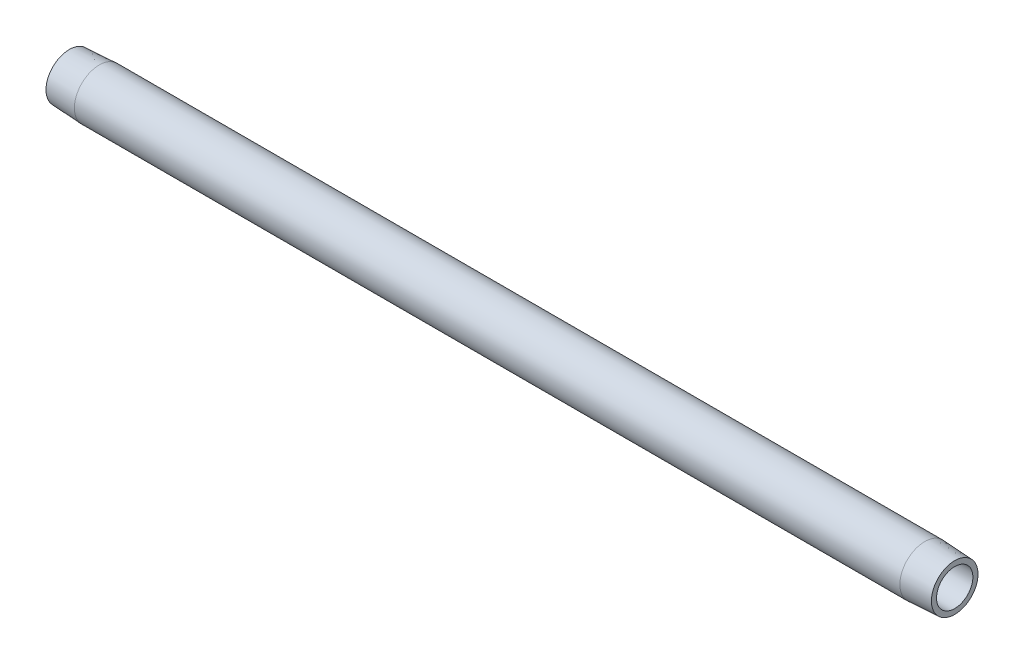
ISO-10303-21;
HEADER;
FILE_DESCRIPTION(('STEP AP214'),'2;1');
FILE_NAME('part.step','',(''),(''),'','','');
FILE_SCHEMA(('AUTOMOTIVE_DESIGN { 1 0 10303 214 1 1 1 1 }'));
ENDSEC;
DATA;
#1=APPLICATION_CONTEXT('core data for automotive mechanical design processes');
#2=APPLICATION_PROTOCOL_DEFINITION('international standard','automotive_design',2000,#1);
#3=PRODUCT_CONTEXT('',#1,'mechanical');
#4=PRODUCT('Part','Part','',(#3));
#5=PRODUCT_RELATED_PRODUCT_CATEGORY('part','',(#4));
#6=PRODUCT_DEFINITION_FORMATION('','',#4);
#7=PRODUCT_DEFINITION_CONTEXT('part definition',#1,'design');
#8=PRODUCT_DEFINITION('design','',#6,#7);
#9=PRODUCT_DEFINITION_SHAPE('','',#8);
#10=(LENGTH_UNIT() NAMED_UNIT(*) SI_UNIT(.MILLI.,.METRE.));
#11=(NAMED_UNIT(*) PLANE_ANGLE_UNIT() SI_UNIT($,.RADIAN.));
#12=(NAMED_UNIT(*) SI_UNIT($,.STERADIAN.) SOLID_ANGLE_UNIT());
#13=UNCERTAINTY_MEASURE_WITH_UNIT(LENGTH_MEASURE(1.E-05),#10,'distance_accuracy_value','');
#14=(GEOMETRIC_REPRESENTATION_CONTEXT(3) GLOBAL_UNCERTAINTY_ASSIGNED_CONTEXT((#13)) GLOBAL_UNIT_ASSIGNED_CONTEXT((#10,
#11,#12)) REPRESENTATION_CONTEXT('',''));
#15=CARTESIAN_POINT('',(0.,0.,0.));
#16=DIRECTION('',(0.,0.,1.));
#17=DIRECTION('',(1.,0.,0.));
#18=AXIS2_PLACEMENT_3D('',#15,#16,#17);
#19=CARTESIAN_POINT('',(304.8,6.26110000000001,0.));
#20=DIRECTION('',(-1.,0.,0.));
#21=DIRECTION('',(0.,0.,1.));
#22=AXIS2_PLACEMENT_3D('',#19,#20,#21);
#23=PLANE('',#22);
#24=CARTESIAN_POINT('',(304.8,0.,0.));
#25=DIRECTION('',(-1.,0.,0.));
#26=DIRECTION('',(0.,0.,1.));
#27=AXIS2_PLACEMENT_3D('',#24,#25,#26);
#28=CIRCLE('',#27,8.03205001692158);
#29=CARTESIAN_POINT('',(304.8,0.,8.03205001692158));
#30=VERTEX_POINT('',#29);
#31=EDGE_CURVE('E10',#30,#30,#28,.T.);
#32=ORIENTED_EDGE('',*,*,#31,.F.);
#33=EDGE_LOOP('',(#32));
#34=FACE_BOUND('',#33,.T.);
#35=CARTESIAN_POINT('',(304.8,0.,0.));
#36=DIRECTION('',(-1.,0.,0.));
#37=DIRECTION('',(0.,0.,1.));
#38=AXIS2_PLACEMENT_3D('',#35,#36,#37);
#39=CIRCLE('',#38,6.26110000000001);
#40=CARTESIAN_POINT('',(304.8,0.,6.26110000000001));
#41=VERTEX_POINT('',#40);
#42=EDGE_CURVE('E52',#41,#41,#39,.T.);
#43=ORIENTED_EDGE('',*,*,#42,.T.);
#44=EDGE_LOOP('',(#43));
#45=FACE_BOUND('',#44,.T.);
#46=ADVANCED_FACE('F30',(#34,#45),#23,.F.);
#47=CARTESIAN_POINT('',(304.8,0.,0.));
#48=DIRECTION('',(-1.,0.,0.));
#49=DIRECTION('',(0.,0.,1.));
#50=AXIS2_PLACEMENT_3D('',#47,#48,#49);
#51=CONICAL_SURFACE('',#50,8.03205001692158,0.0523598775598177);
#52=CARTESIAN_POINT('',(294.4876,0.,0.));
#53=DIRECTION('',(-1.,0.,0.));
#54=DIRECTION('',(0.,0.,1.));
#55=AXIS2_PLACEMENT_3D('',#52,#53,#54);
#56=CIRCLE('',#55,8.57249999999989);
#57=CARTESIAN_POINT('',(294.4876,0.,8.57249999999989));
#58=VERTEX_POINT('',#57);
#59=EDGE_CURVE('E36',#58,#58,#56,.T.);
#60=ORIENTED_EDGE('',*,*,#59,.F.);
#61=EDGE_LOOP('',(#60));
#62=FACE_BOUND('',#61,.T.);
#63=ORIENTED_EDGE('',*,*,#31,.T.);
#64=EDGE_LOOP('',(#63));
#65=FACE_BOUND('',#64,.T.);
#66=ADVANCED_FACE('F77',(#62,#65),#51,.T.);
#67=CARTESIAN_POINT('',(0.,0.,0.));
#68=DIRECTION('',(-1.,0.,0.));
#69=DIRECTION('',(0.,0.,1.));
#70=AXIS2_PLACEMENT_3D('',#67,#68,#69);
#71=CYLINDRICAL_SURFACE('',#70,8.57249999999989);
#72=CARTESIAN_POINT('',(10.3124,0.,0.));
#73=DIRECTION('',(-1.,0.,0.));
#74=DIRECTION('',(0.,0.,1.));
#75=AXIS2_PLACEMENT_3D('',#72,#73,#74);
#76=CIRCLE('',#75,8.57249999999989);
#77=CARTESIAN_POINT('',(10.3124,0.,8.57249999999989));
#78=VERTEX_POINT('',#77);
#79=EDGE_CURVE('E40',#78,#78,#76,.T.);
#80=ORIENTED_EDGE('',*,*,#79,.F.);
#81=EDGE_LOOP('',(#80));
#82=FACE_BOUND('',#81,.T.);
#83=ORIENTED_EDGE('',*,*,#59,.T.);
#84=EDGE_LOOP('',(#83));
#85=FACE_BOUND('',#84,.T.);
#86=ADVANCED_FACE('F72',(#82,#85),#71,.T.);
#87=CARTESIAN_POINT('',(10.3124,0.,0.));
#88=DIRECTION('',(1.,0.,0.));
#89=DIRECTION('',(0.,0.,-1.));
#90=AXIS2_PLACEMENT_3D('',#87,#88,#89);
#91=CONICAL_SURFACE('',#90,8.57249999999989,0.0523598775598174);
#92=CARTESIAN_POINT('',(0.,0.,0.));
#93=DIRECTION('',(-1.,0.,0.));
#94=DIRECTION('',(0.,0.,1.));
#95=AXIS2_PLACEMENT_3D('',#92,#93,#94);
#96=CIRCLE('',#95,8.03205001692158);
#97=CARTESIAN_POINT('',(0.,0.,8.03205001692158));
#98=VERTEX_POINT('',#97);
#99=EDGE_CURVE('E44',#98,#98,#96,.T.);
#100=ORIENTED_EDGE('',*,*,#99,.F.);
#101=EDGE_LOOP('',(#100));
#102=FACE_BOUND('',#101,.T.);
#103=ORIENTED_EDGE('',*,*,#79,.T.);
#104=EDGE_LOOP('',(#103));
#105=FACE_BOUND('',#104,.T.);
#106=ADVANCED_FACE('F66',(#102,#105),#91,.T.);
#107=CARTESIAN_POINT('',(0.,6.26110000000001,0.));
#108=DIRECTION('',(1.,0.,0.));
#109=DIRECTION('',(0.,0.,-1.));
#110=AXIS2_PLACEMENT_3D('',#107,#108,#109);
#111=PLANE('',#110);
#112=CARTESIAN_POINT('',(0.,0.,0.));
#113=DIRECTION('',(-1.,0.,0.));
#114=DIRECTION('',(0.,0.,1.));
#115=AXIS2_PLACEMENT_3D('',#112,#113,#114);
#116=CIRCLE('',#115,6.26110000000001);
#117=CARTESIAN_POINT('',(0.,0.,6.26110000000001));
#118=VERTEX_POINT('',#117);
#119=EDGE_CURVE('E49',#118,#118,#116,.T.);
#120=ORIENTED_EDGE('',*,*,#119,.F.);
#121=EDGE_LOOP('',(#120));
#122=FACE_BOUND('',#121,.T.);
#123=ORIENTED_EDGE('',*,*,#99,.T.);
#124=EDGE_LOOP('',(#123));
#125=FACE_BOUND('',#124,.T.);
#126=ADVANCED_FACE('F60',(#122,#125),#111,.F.);
#127=CARTESIAN_POINT('',(0.,0.,0.));
#128=DIRECTION('',(-1.,0.,0.));
#129=DIRECTION('',(0.,0.,1.));
#130=AXIS2_PLACEMENT_3D('',#127,#128,#129);
#131=CYLINDRICAL_SURFACE('',#130,6.26110000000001);
#132=ORIENTED_EDGE('',*,*,#42,.F.);
#133=EDGE_LOOP('',(#132));
#134=FACE_BOUND('',#133,.T.);
#135=ORIENTED_EDGE('',*,*,#119,.T.);
#136=EDGE_LOOP('',(#135));
#137=FACE_BOUND('',#136,.T.);
#138=ADVANCED_FACE('F57',(#134,#137),#131,.F.);
#139=CLOSED_SHELL('',(#46,#66,#86,#106,#126,#138));
#140=MANIFOLD_SOLID_BREP('B2',#139);
#141=ADVANCED_BREP_SHAPE_REPRESENTATION('',(#18,#140),#14);
#142=SHAPE_DEFINITION_REPRESENTATION(#9,#141);
ENDSEC;
END-ISO-10303-21;
